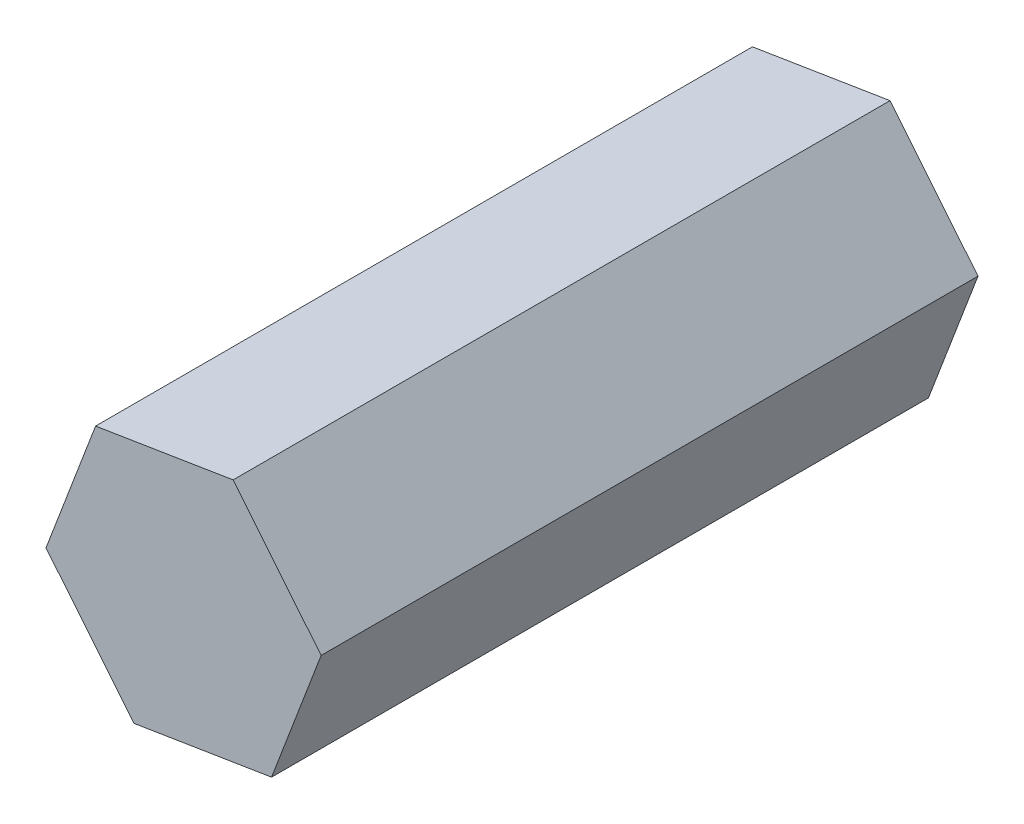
from build123d import *

# Parameters (mm, degrees)
BOSS_EXTRUDE1_DEPTH = 140


with BuildPart() as part:
    # Sketch1 → Boss-Extrude1 (new body)
    with BuildSketch(Plane.XY):
        Polygon((18.753166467, -23.02755857), (29.319033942, 4.726939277), (10.565867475, 27.754497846), (-18.753166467, 23.02755857), (-29.319033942, -4.726939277), (-10.565867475, -27.754497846), align=None)
    extrude(amount=BOSS_EXTRUDE1_DEPTH)


solid = part.part
